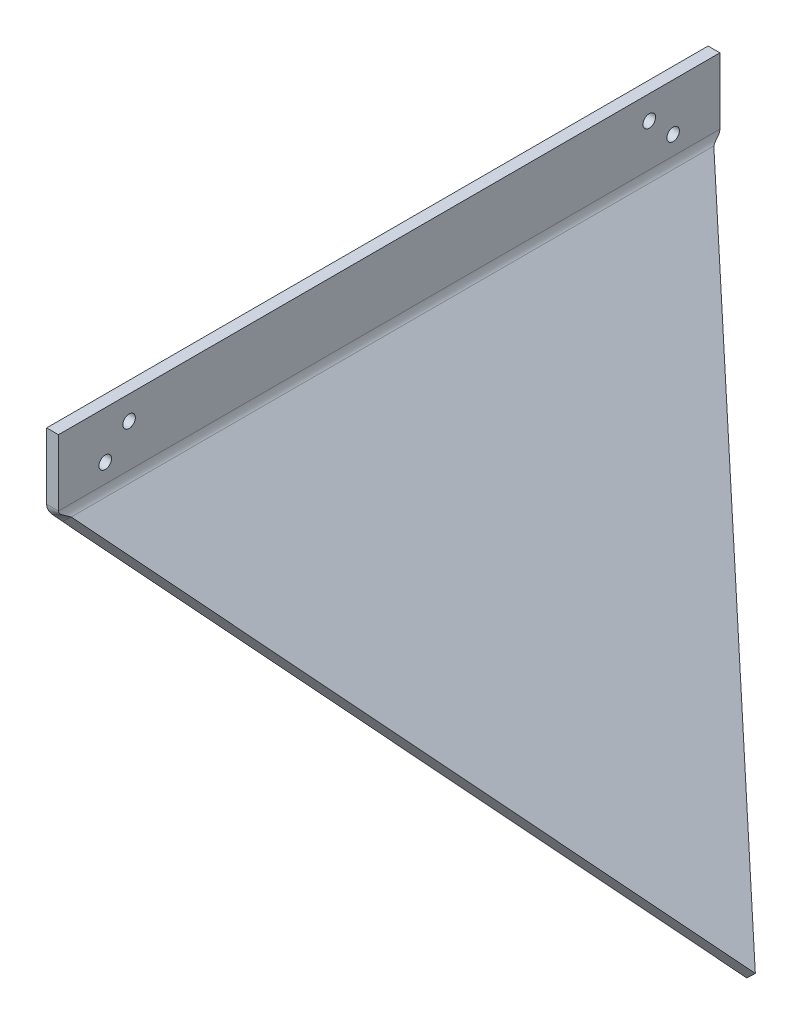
ISO-10303-21;
HEADER;
FILE_DESCRIPTION(('STEP AP214'),'2;1');
FILE_NAME('part.step','',(''),(''),'','','');
FILE_SCHEMA(('AUTOMOTIVE_DESIGN { 1 0 10303 214 1 1 1 1 }'));
ENDSEC;
DATA;
#1=APPLICATION_CONTEXT('core data for automotive mechanical design processes');
#2=APPLICATION_PROTOCOL_DEFINITION('international standard','automotive_design',2000,#1);
#3=PRODUCT_CONTEXT('',#1,'mechanical');
#4=PRODUCT('Part','Part','',(#3));
#5=PRODUCT_RELATED_PRODUCT_CATEGORY('part','',(#4));
#6=PRODUCT_DEFINITION_FORMATION('','',#4);
#7=PRODUCT_DEFINITION_CONTEXT('part definition',#1,'design');
#8=PRODUCT_DEFINITION('design','',#6,#7);
#9=PRODUCT_DEFINITION_SHAPE('','',#8);
#10=(LENGTH_UNIT() NAMED_UNIT(*) SI_UNIT(.MILLI.,.METRE.));
#11=(NAMED_UNIT(*) PLANE_ANGLE_UNIT() SI_UNIT($,.RADIAN.));
#12=(NAMED_UNIT(*) SI_UNIT($,.STERADIAN.) SOLID_ANGLE_UNIT());
#13=UNCERTAINTY_MEASURE_WITH_UNIT(LENGTH_MEASURE(1.E-05),#10,'distance_accuracy_value','');
#14=(GEOMETRIC_REPRESENTATION_CONTEXT(3) GLOBAL_UNCERTAINTY_ASSIGNED_CONTEXT((#13)) GLOBAL_UNIT_ASSIGNED_CONTEXT((#10,
#11,#12)) REPRESENTATION_CONTEXT('',''));
#15=CARTESIAN_POINT('',(0.,0.,0.));
#16=DIRECTION('',(0.,0.,1.));
#17=DIRECTION('',(1.,0.,0.));
#18=AXIS2_PLACEMENT_3D('',#15,#16,#17);
#19=CARTESIAN_POINT('',(-393.7,406.4,355.6));
#20=DIRECTION('',(-0.718240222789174,-0.695795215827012,0.));
#21=DIRECTION('',(0.695795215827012,-0.718240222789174,0.));
#22=AXIS2_PLACEMENT_3D('',#19,#20,#21);
#23=PLANE('',#22);
#24=DIRECTION('',(0.59237079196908,-0.611479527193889,-0.524585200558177));
#25=VECTOR('',#24,1.);
#26=CARTESIAN_POINT('',(-395.860168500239,408.629851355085,350.561487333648));
#27=LINE('',#26,#25);
#28=CARTESIAN_POINT('',(-390.121650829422,402.706220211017,345.479634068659));
#29=VERTEX_POINT('',#28);
#30=CARTESIAN_POINT('',(0.,0.,0.));
#31=VERTEX_POINT('',#30);
#32=EDGE_CURVE('E114',#29,#31,#27,.T.);
#33=ORIENTED_EDGE('',*,*,#32,.T.);
#34=DIRECTION('',(-0.59237079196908,0.611479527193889,-0.524585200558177));
#35=VECTOR('',#34,1.);
#36=CARTESIAN_POINT('',(-174.855514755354,180.496015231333,-154.846620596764));
#37=LINE('',#36,#35);
#38=CARTESIAN_POINT('',(-390.121650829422,402.706220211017,-345.479634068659));
#39=VERTEX_POINT('',#38);
#40=EDGE_CURVE('E144',#31,#39,#37,.T.);
#41=ORIENTED_EDGE('',*,*,#40,.T.);
#42=DIRECTION('',(0.,0.,-1.));
#43=VECTOR('',#42,1.);
#44=CARTESIAN_POINT('',(-390.121650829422,402.706220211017,355.6));
#45=LINE('',#44,#43);
#46=EDGE_CURVE('E139',#39,#29,#45,.F.);
#47=ORIENTED_EDGE('',*,*,#46,.T.);
#48=EDGE_LOOP('',(#33,#41,#47));
#49=FACE_BOUND('',#48,.T.);
#50=ADVANCED_FACE('F39',(#49),#23,.F.);
#51=CARTESIAN_POINT('',(-381.,411.54281945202,355.6));
#52=DIRECTION('',(0.,0.,1.));
#53=DIRECTION('',(1.,0.,0.));
#54=AXIS2_PLACEMENT_3D('',#51,#52,#53);
#55=CYLINDRICAL_SURFACE('',#54,12.7);
#56=CARTESIAN_POINT('',(-393.7,411.54281945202,355.6));
#57=CARTESIAN_POINT('',(-393.700000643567,411.483489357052,355.600002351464));
#58=CARTESIAN_POINT('',(-393.699584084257,411.42416786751,355.598680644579));
#59=CARTESIAN_POINT('',(-393.697923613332,411.305658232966,355.593396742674));
#60=CARTESIAN_POINT('',(-393.696679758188,411.24647007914,355.589434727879));
#61=CARTESIAN_POINT('',(-393.691722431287,411.069435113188,355.57361435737));
#62=CARTESIAN_POINT('',(-393.686783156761,410.951948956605,355.557821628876));
#63=CARTESIAN_POINT('',(-393.673867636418,410.720398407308,355.516392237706));
#64=CARTESIAN_POINT('',(-393.665928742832,410.606309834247,355.490876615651));
#65=CARTESIAN_POINT('',(-393.647231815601,410.380781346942,355.430663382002));
#66=CARTESIAN_POINT('',(-393.636472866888,410.269342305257,355.395962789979));
#67=CARTESIAN_POINT('',(-393.617064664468,410.092207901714,355.333232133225));
#68=CARTESIAN_POINT('',(-393.609208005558,410.025484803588,355.307810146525));
#69=CARTESIAN_POINT('',(-393.592607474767,409.893373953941,355.253958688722));
#70=CARTESIAN_POINT('',(-393.583863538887,409.827986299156,355.225529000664));
#71=CARTESIAN_POINT('',(-393.556391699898,409.633865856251,355.136075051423));
#72=CARTESIAN_POINT('',(-393.536425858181,409.507194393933,355.070892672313));
#73=CARTESIAN_POINT('',(-393.504362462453,409.32135531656,354.9658392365));
#74=CARTESIAN_POINT('',(-393.493291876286,409.259955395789,354.929508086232));
#75=CARTESIAN_POINT('',(-393.47052148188,409.138677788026,354.854619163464));
#76=CARTESIAN_POINT('',(-393.458821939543,409.078799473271,354.81606233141));
#77=CARTESIAN_POINT('',(-393.434851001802,408.960548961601,354.736860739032));
#78=CARTESIAN_POINT('',(-393.422579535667,408.902176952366,354.696215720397));
#79=CARTESIAN_POINT('',(-393.397527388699,408.786954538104,354.612962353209));
#80=CARTESIAN_POINT('',(-393.384746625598,408.730104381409,354.570353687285));
#81=CARTESIAN_POINT('',(-393.330756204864,408.497270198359,354.389913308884));
#82=CARTESIAN_POINT('',(-393.287472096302,408.327789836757,354.244206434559));
#83=CARTESIAN_POINT('',(-393.197791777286,408.002713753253,353.938930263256));
#84=CARTESIAN_POINT('',(-393.151393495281,407.847127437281,353.77935171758));
#85=CARTESIAN_POINT('',(-393.056591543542,407.548683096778,353.449054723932));
#86=CARTESIAN_POINT('',(-393.008186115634,407.405836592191,353.278326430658));
#87=CARTESIAN_POINT('',(-392.91029874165,407.131932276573,352.928114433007));
#88=CARTESIAN_POINT('',(-392.86081719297,407.000870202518,352.748633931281));
#89=CARTESIAN_POINT('',(-392.776090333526,406.786478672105,352.436562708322));
#90=CARTESIAN_POINT('',(-392.740952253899,406.700475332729,352.305761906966));
#91=CARTESIAN_POINT('',(-392.670793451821,406.533759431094,352.041645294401));
#92=CARTESIAN_POINT('',(-392.635772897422,406.453025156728,351.908343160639));
#93=CARTESIAN_POINT('',(-392.600819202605,406.374551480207,351.773719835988));
#94=B_SPLINE_CURVE_WITH_KNOTS('',3,(#56,#57,#58,#59,#60,#61,#62,#63,#64,#65,#66,#67,#68,#69,#70,
#71,#72,#73,#74,#75,#76,#77,#78,#79,#80,#81,#82,#83,#84,#85,#86,#87,#88,#89,#90,#91,#92,#93),
.UNSPECIFIED.,.F.,.F.,(4,2,2,2,2,2,2,2,2,2,2,2,2,2,2,2,2,2,4),(0.,0.177956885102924,
0.355901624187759,0.711286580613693,1.0623846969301,1.41359688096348,1.62902052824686,
1.84445972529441,2.27539818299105,2.49195300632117,2.70841698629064,2.92490780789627,
3.14143374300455,3.82323396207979,4.50549229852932,5.18836143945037,5.87098254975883,
6.35219440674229,6.83127855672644),.UNSPECIFIED.);
#95=CARTESIAN_POINT('',(-393.7,411.54281945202,355.6));
#96=VERTEX_POINT('',#95);
#97=CARTESIAN_POINT('',(-392.600819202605,406.374551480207,351.773719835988));
#98=VERTEX_POINT('',#97);
#99=EDGE_CURVE('E123',#96,#98,#94,.T.);
#100=ORIENTED_EDGE('',*,*,#99,.T.);
#101=CARTESIAN_POINT('',(-381.,411.54281945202,360.641381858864));
#102=DIRECTION('',(0.,0.863971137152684,-0.503541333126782));
#103=DIRECTION('',(0.,0.503541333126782,0.863971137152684));
#104=AXIS2_PLACEMENT_3D('',#101,#102,#103);
#105=ELLIPSE('',#104,25.2213654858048,12.7);
#106=EDGE_CURVE('E129',#98,#29,#105,.F.);
#107=ORIENTED_EDGE('',*,*,#106,.T.);
#108=ORIENTED_EDGE('',*,*,#46,.F.);
#109=CARTESIAN_POINT('',(-381.,411.54281945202,-360.641381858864));
#110=DIRECTION('',(0.,0.863971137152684,0.503541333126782));
#111=DIRECTION('',(0.,-0.503541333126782,0.863971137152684));
#112=AXIS2_PLACEMENT_3D('',#109,#110,#111);
#113=ELLIPSE('',#112,25.2213654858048,12.7);
#114=CARTESIAN_POINT('',(-392.600819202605,406.374551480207,-351.773719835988));
#115=VERTEX_POINT('',#114);
#116=EDGE_CURVE('E197',#39,#115,#113,.F.);
#117=ORIENTED_EDGE('',*,*,#116,.T.);
#118=CARTESIAN_POINT('',(-392.600819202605,406.374551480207,-351.773719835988));
#119=CARTESIAN_POINT('',(-392.63641931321,406.454477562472,-351.910831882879));
#120=CARTESIAN_POINT('',(-392.672101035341,406.536775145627,-352.046564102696));
#121=CARTESIAN_POINT('',(-392.743441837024,406.706488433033,-352.314858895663));
#122=CARTESIAN_POINT('',(-392.779100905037,406.793905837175,-352.447420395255));
#123=CARTESIAN_POINT('',(-392.850779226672,406.975684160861,-352.711051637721));
#124=CARTESIAN_POINT('',(-392.886794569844,407.070136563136,-352.842059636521));
#125=CARTESIAN_POINT('',(-392.958327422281,407.265064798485,-353.099662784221));
#126=CARTESIAN_POINT('',(-392.993844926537,407.36554069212,-353.226257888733));
#127=CARTESIAN_POINT('',(-393.075875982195,407.60776832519,-353.515941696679));
#128=CARTESIAN_POINT('',(-393.122079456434,407.752055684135,-353.677019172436));
#129=CARTESIAN_POINT('',(-393.212195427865,408.053262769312,-353.987827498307));
#130=CARTESIAN_POINT('',(-393.256106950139,408.210187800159,-354.137553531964));
#131=CARTESIAN_POINT('',(-393.340190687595,408.536512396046,-354.42159485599));
#132=CARTESIAN_POINT('',(-393.380385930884,408.705821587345,-354.556006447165));
#133=CARTESIAN_POINT('',(-393.455871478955,409.058133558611,-354.8070127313));
#134=CARTESIAN_POINT('',(-393.491167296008,409.241120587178,-354.923627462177));
#135=CARTESIAN_POINT('',(-393.54057030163,409.534082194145,-355.085884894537));
#136=CARTESIAN_POINT('',(-393.556990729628,409.639219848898,-355.139611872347));
#137=CARTESIAN_POINT('',(-393.587596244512,409.853405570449,-355.239403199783));
#138=CARTESIAN_POINT('',(-393.601781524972,409.962453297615,-355.285468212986));
#139=CARTESIAN_POINT('',(-393.627574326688,410.183865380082,-355.368924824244));
#140=CARTESIAN_POINT('',(-393.639187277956,410.296222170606,-355.40633470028));
#141=CARTESIAN_POINT('',(-393.659572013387,410.523853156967,-355.471760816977));
#142=CARTESIAN_POINT('',(-393.668344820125,410.639126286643,-355.499780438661));
#143=CARTESIAN_POINT('',(-393.683598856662,410.884746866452,-355.548323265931));
#144=CARTESIAN_POINT('',(-393.689720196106,411.015353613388,-355.567677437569));
#145=CARTESIAN_POINT('',(-393.695872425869,411.212410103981,-355.587062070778));
#146=CARTESIAN_POINT('',(-393.697418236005,411.278374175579,-355.591915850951));
#147=CARTESIAN_POINT('',(-393.699482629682,411.410494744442,-355.598386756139));
#148=CARTESIAN_POINT('',(-393.700000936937,411.476651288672,-355.600003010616));
#149=CARTESIAN_POINT('',(-393.7,411.54281945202,-355.6));
#150=B_SPLINE_CURVE_WITH_KNOTS('',3,(#118,#119,#120,#121,#122,#123,#124,#125,#126,#127,#128,
#129,#130,#131,#132,#133,#134,#135,#136,#137,#138,#139,#140,#141,#142,#143,#144,#145,#146,#147,
#148,#149),.UNSPECIFIED.,.F.,.F.,(4,2,2,2,2,2,2,2,2,2,2,2,2,2,2,4),(0.,0.487958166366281,
0.976079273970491,1.47234059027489,1.96860689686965,2.63142434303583,3.29452146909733,
3.95318721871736,4.61110580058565,4.96844668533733,5.32575660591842,5.68230492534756,
6.03872472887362,6.43449124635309,6.63289707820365,6.83135625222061),.UNSPECIFIED.);
#151=CARTESIAN_POINT('',(-393.7,411.54281945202,-355.6));
#152=VERTEX_POINT('',#151);
#153=EDGE_CURVE('E199',#115,#152,#150,.T.);
#154=ORIENTED_EDGE('',*,*,#153,.T.);
#155=DIRECTION('',(0.,0.,-1.));
#156=VECTOR('',#155,1.);
#157=CARTESIAN_POINT('',(-393.7,411.54281945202,-355.6));
#158=LINE('',#157,#156);
#159=EDGE_CURVE('E146',#96,#152,#158,.T.);
#160=ORIENTED_EDGE('',*,*,#159,.F.);
#161=EDGE_LOOP('',(#100,#107,#108,#117,#154,#160));
#162=FACE_BOUND('',#161,.T.);
#163=ADVANCED_FACE('F137',(#162),#55,.F.);
#164=CARTESIAN_POINT('',(-402.821650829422,397.563400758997,355.6));
#165=DIRECTION('',(-0.718240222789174,-0.695795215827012,0.));
#166=DIRECTION('',(0.695795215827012,-0.718240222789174,0.));
#167=AXIS2_PLACEMENT_3D('',#164,#165,#166);
#168=PLANE('',#167);
#169=DIRECTION('',(-0.59237079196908,0.611479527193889,-0.524585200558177));
#170=VECTOR('',#169,1.);
#171=CARTESIAN_POINT('',(-183.977165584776,171.65941599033,-154.846620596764));
#172=LINE('',#171,#170);
#173=CARTESIAN_POINT('',(-9.12165082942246,-8.83659924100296,0.));
#174=VERTEX_POINT('',#173);
#175=CARTESIAN_POINT('',(-399.243301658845,393.869620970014,-345.479634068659));
#176=VERTEX_POINT('',#175);
#177=EDGE_CURVE('E186',#174,#176,#172,.T.);
#178=ORIENTED_EDGE('',*,*,#177,.F.);
#179=DIRECTION('',(0.59237079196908,-0.611479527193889,-0.524585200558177));
#180=VECTOR('',#179,1.);
#181=CARTESIAN_POINT('',(-404.981819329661,399.793252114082,350.561487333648));
#182=LINE('',#181,#180);
#183=CARTESIAN_POINT('',(-399.243301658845,393.869620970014,345.479634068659));
#184=VERTEX_POINT('',#183);
#185=EDGE_CURVE('E80',#184,#174,#182,.T.);
#186=ORIENTED_EDGE('',*,*,#185,.F.);
#187=DIRECTION('',(0.,0.,1.));
#188=VECTOR('',#187,1.);
#189=CARTESIAN_POINT('',(-399.243301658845,393.869620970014,355.6));
#190=LINE('',#189,#188);
#191=EDGE_CURVE('E155',#176,#184,#190,.T.);
#192=ORIENTED_EDGE('',*,*,#191,.F.);
#193=EDGE_LOOP('',(#178,#186,#192));
#194=FACE_BOUND('',#193,.T.);
#195=ADVANCED_FACE('F230',(#194),#168,.T.);
#196=CARTESIAN_POINT('',(-381.,411.54281945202,355.6));
#197=DIRECTION('',(0.,0.,1.));
#198=DIRECTION('',(1.,0.,0.));
#199=AXIS2_PLACEMENT_3D('',#196,#197,#198);
#200=CYLINDRICAL_SURFACE('',#199,25.4);
#201=CARTESIAN_POINT('',(-381.,411.54281945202,360.641381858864));
#202=DIRECTION('',(0.,0.651120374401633,-0.758974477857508));
#203=DIRECTION('',(0.,0.758974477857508,0.651120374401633));
#204=AXIS2_PLACEMENT_3D('',#201,#202,#203);
#205=ELLIPSE('',#204,33.4662109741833,25.4);
#206=CARTESIAN_POINT('',(-404.20163840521,401.206283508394,351.773719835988));
#207=VERTEX_POINT('',#206);
#208=EDGE_CURVE('E132',#207,#184,#205,.F.);
#209=ORIENTED_EDGE('',*,*,#208,.F.);
#210=CARTESIAN_POINT('',(-406.4,411.54281945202,355.6));
#211=CARTESIAN_POINT('',(-406.400002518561,411.376950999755,355.600005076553));
#212=CARTESIAN_POINT('',(-406.398375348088,411.211082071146,355.597423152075));
#213=CARTESIAN_POINT('',(-406.391879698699,410.879573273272,355.587075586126));
#214=CARTESIAN_POINT('',(-406.387011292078,410.71393339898,355.579310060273));
#215=CARTESIAN_POINT('',(-406.374053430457,410.383161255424,355.558589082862));
#216=CARTESIAN_POINT('',(-406.365965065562,410.218028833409,355.545635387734));
#217=CARTESIAN_POINT('',(-406.346602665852,409.88843668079,355.514567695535));
#218=CARTESIAN_POINT('',(-406.335328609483,409.723976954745,355.496453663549));
#219=CARTESIAN_POINT('',(-406.309686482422,409.396507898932,355.455181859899));
#220=CARTESIAN_POINT('',(-406.29532908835,409.233495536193,355.432041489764));
#221=CARTESIAN_POINT('',(-406.263556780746,408.908555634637,355.380791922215));
#222=CARTESIAN_POINT('',(-406.246141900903,408.746628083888,355.352682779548));
#223=CARTESIAN_POINT('',(-406.208325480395,408.424053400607,355.291466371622));
#224=CARTESIAN_POINT('',(-406.187923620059,408.263406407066,355.258358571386));
#225=CARTESIAN_POINT('',(-406.144215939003,407.94358965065,355.187274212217));
#226=CARTESIAN_POINT('',(-406.120910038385,407.78441992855,355.149297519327));
#227=CARTESIAN_POINT('',(-406.067548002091,407.442508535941,355.062176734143));
#228=CARTESIAN_POINT('',(-406.037007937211,407.260049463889,355.012217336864));
#229=CARTESIAN_POINT('',(-405.972302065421,406.897604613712,354.906069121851));
#230=CARTESIAN_POINT('',(-405.938136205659,406.717618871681,354.849880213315));
#231=CARTESIAN_POINT('',(-405.866347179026,406.360351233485,354.731346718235));
#232=CARTESIAN_POINT('',(-405.828723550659,406.183069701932,354.669001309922));
#233=CARTESIAN_POINT('',(-405.769845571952,405.919398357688,354.570935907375));
#234=CARTESIAN_POINT('',(-405.749812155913,405.831881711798,354.537488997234));
#235=CARTESIAN_POINT('',(-405.708949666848,405.657599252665,354.469145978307));
#236=CARTESIAN_POINT('',(-405.688120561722,405.570833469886,354.434249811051));
#237=CARTESIAN_POINT('',(-405.624419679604,405.311472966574,354.327289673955));
#238=CARTESIAN_POINT('',(-405.580387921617,405.140054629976,354.253043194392));
#239=CARTESIAN_POINT('',(-405.489446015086,404.800570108,354.098869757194));
#240=CARTESIAN_POINT('',(-405.442535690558,404.632504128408,354.018942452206));
#241=CARTESIAN_POINT('',(-405.297839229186,404.133716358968,353.770879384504));
#242=CARTESIAN_POINT('',(-405.196052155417,403.808261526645,353.59440332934));
#243=CARTESIAN_POINT('',(-404.953509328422,403.082665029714,353.167390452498));
#244=CARTESIAN_POINT('',(-404.809881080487,402.687473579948,352.910033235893));
#245=CARTESIAN_POINT('',(-404.586729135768,402.115840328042,352.500632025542));
#246=CARTESIAN_POINT('',(-404.511195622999,401.92912219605,352.360529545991));
#247=CARTESIAN_POINT('',(-404.357942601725,401.5625410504,352.072737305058));
#248=CARTESIAN_POINT('',(-404.28022300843,401.382678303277,351.925047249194));
#249=CARTESIAN_POINT('',(-404.20163840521,401.206283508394,351.773719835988));
#250=B_SPLINE_CURVE_WITH_KNOTS('',3,(#210,#211,#212,#213,#214,#215,#216,#217,#218,#219,#220,
#221,#222,#223,#224,#225,#226,#227,#228,#229,#230,#231,#232,#233,#234,#235,#236,#237,#238,#239,
#240,#241,#242,#243,#244,#245,#246,#247,#248,#249),.UNSPECIFIED.,.F.,.F.,(4,2,2,2,2,2,2,2,2,2,2,
2,2,2,2,2,2,2,2,4),(0.,0.497577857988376,0.995144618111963,1.49254307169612,1.98994489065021,
2.48565136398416,2.98135237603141,3.47710647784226,3.9728742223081,4.54758927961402,
5.12231271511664,5.69711296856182,5.98452212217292,6.271942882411,6.84756731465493,
7.42322697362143,8.57407067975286,10.0508261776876,10.7866972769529,11.5225969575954),.UNSPECIFIED.);
#251=CARTESIAN_POINT('',(-406.4,411.54281945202,355.6));
#252=VERTEX_POINT('',#251);
#253=EDGE_CURVE('E141',#252,#207,#250,.T.);
#254=ORIENTED_EDGE('',*,*,#253,.F.);
#255=DIRECTION('',(0.,0.,1.));
#256=VECTOR('',#255,1.);
#257=CARTESIAN_POINT('',(-406.4,411.54281945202,355.6));
#258=LINE('',#257,#256);
#259=CARTESIAN_POINT('',(-406.4,411.54281945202,-355.6));
#260=VERTEX_POINT('',#259);
#261=EDGE_CURVE('E159',#252,#260,#258,.F.);
#262=ORIENTED_EDGE('',*,*,#261,.T.);
#263=CARTESIAN_POINT('',(-404.20163840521,401.206283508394,-351.773719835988));
#264=CARTESIAN_POINT('',(-404.301121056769,401.42956736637,-351.965278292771));
#265=CARTESIAN_POINT('',(-404.399251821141,401.658521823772,-352.150968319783));
#266=CARTESIAN_POINT('',(-404.591940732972,402.127691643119,-352.510239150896));
#267=CARTESIAN_POINT('',(-404.68649415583,402.367921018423,-352.683804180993));
#268=CARTESIAN_POINT('',(-404.870942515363,402.859100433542,-353.018036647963));
#269=CARTESIAN_POINT('',(-404.960835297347,403.110055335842,-353.178698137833));
#270=CARTESIAN_POINT('',(-405.134916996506,403.622033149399,-353.486353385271));
#271=CARTESIAN_POINT('',(-405.219107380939,403.883053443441,-353.63335066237));
#272=CARTESIAN_POINT('',(-405.380816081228,404.414501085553,-353.912995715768));
#273=CARTESIAN_POINT('',(-405.458337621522,404.684923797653,-354.045650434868));
#274=CARTESIAN_POINT('',(-405.605805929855,405.234477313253,-354.295982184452));
#275=CARTESIAN_POINT('',(-405.675756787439,405.513603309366,-354.413667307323));
#276=CARTESIAN_POINT('',(-405.767065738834,405.90675364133,-354.566303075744));
#277=CARTESIAN_POINT('',(-405.791994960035,406.017427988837,-354.607862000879));
#278=CARTESIAN_POINT('',(-405.840534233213,406.239912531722,-354.688642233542));
#279=CARTESIAN_POINT('',(-405.864144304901,406.3517227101,-354.727863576));
#280=CARTESIAN_POINT('',(-405.932924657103,406.688765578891,-354.84191070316));
#281=CARTESIAN_POINT('',(-405.97605447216,406.915650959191,-354.913135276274));
#282=CARTESIAN_POINT('',(-406.056457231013,407.372955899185,-355.045431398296));
#283=CARTESIAN_POINT('',(-406.093739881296,407.603368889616,-355.106519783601));
#284=CARTESIAN_POINT('',(-406.162231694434,408.067600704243,-355.218329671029));
#285=CARTESIAN_POINT('',(-406.19344069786,408.301419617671,-355.26905090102));
#286=CARTESIAN_POINT('',(-406.250793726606,408.782608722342,-355.361911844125));
#287=CARTESIAN_POINT('',(-406.276641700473,409.030110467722,-355.403554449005));
#288=CARTESIAN_POINT('',(-406.321151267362,409.527466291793,-355.474981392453));
#289=CARTESIAN_POINT('',(-406.339812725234,409.777320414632,-355.50476550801));
#290=CARTESIAN_POINT('',(-406.369807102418,410.279381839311,-355.552455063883));
#291=CARTESIAN_POINT('',(-406.381117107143,410.531594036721,-355.570323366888));
#292=CARTESIAN_POINT('',(-406.396220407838,411.036812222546,-355.59410775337));
#293=CARTESIAN_POINT('',(-406.400013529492,411.289818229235,-355.600023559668));
#294=CARTESIAN_POINT('',(-406.4,411.54281945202,-355.6));
#295=B_SPLINE_CURVE_WITH_KNOTS('',3,(#263,#264,#265,#266,#267,#268,#269,#270,#271,#272,#273,
#274,#275,#276,#277,#278,#279,#280,#281,#282,#283,#284,#285,#286,#287,#288,#289,#290,#291,#292,
#293,#294),.UNSPECIFIED.,.F.,.F.,(4,2,2,2,2,2,2,2,2,2,2,2,2,2,2,4),(0.,0.931604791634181,
1.86439981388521,2.79762230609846,3.73060375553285,4.6631315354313,5.5951530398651,
5.95758494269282,6.3200114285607,7.04473162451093,7.76823572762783,8.49175881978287,
9.24829227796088,10.004839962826,10.7637346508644,11.5226469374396),.UNSPECIFIED.);
#296=CARTESIAN_POINT('',(-404.20163840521,401.206283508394,-351.773719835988));
#297=VERTEX_POINT('',#296);
#298=EDGE_CURVE('E190',#297,#260,#295,.T.);
#299=ORIENTED_EDGE('',*,*,#298,.F.);
#300=CARTESIAN_POINT('',(-381.,411.54281945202,-360.641381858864));
#301=DIRECTION('',(0.,0.651120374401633,0.758974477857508));
#302=DIRECTION('',(0.,-0.758974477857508,0.651120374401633));
#303=AXIS2_PLACEMENT_3D('',#300,#301,#302);
#304=ELLIPSE('',#303,33.4662109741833,25.4);
#305=EDGE_CURVE('E198',#176,#297,#304,.F.);
#306=ORIENTED_EDGE('',*,*,#305,.F.);
#307=ORIENTED_EDGE('',*,*,#191,.T.);
#308=EDGE_LOOP('',(#209,#254,#262,#299,#306,#307));
#309=FACE_BOUND('',#308,.T.);
#310=ADVANCED_FACE('F233',(#309),#200,.T.);
#311=CARTESIAN_POINT('',(-393.7,406.4,-355.6));
#312=DIRECTION('',(0.,0.,1.));
#313=DIRECTION('',(0.,1.,0.));
#314=AXIS2_PLACEMENT_3D('',#311,#312,#313);
#315=PLANE('',#314);
#316=DIRECTION('',(1.,0.,0.));
#317=VECTOR('',#316,1.);
#318=CARTESIAN_POINT('',(-393.7,411.54281945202,-355.6));
#319=LINE('',#318,#317);
#320=EDGE_CURVE('E11',#260,#152,#319,.T.);
#321=ORIENTED_EDGE('',*,*,#320,.F.);
#322=DIRECTION('',(0.,-1.,0.));
#323=VECTOR('',#322,1.);
#324=CARTESIAN_POINT('',(-406.4,406.4,-355.6));
#325=LINE('',#324,#323);
#326=CARTESIAN_POINT('',(-406.4,482.6,-355.6));
#327=VERTEX_POINT('',#326);
#328=EDGE_CURVE('E167',#260,#327,#325,.F.);
#329=ORIENTED_EDGE('',*,*,#328,.T.);
#330=DIRECTION('',(1.,0.,0.));
#331=VECTOR('',#330,1.);
#332=CARTESIAN_POINT('',(-393.7,482.6,-355.6));
#333=LINE('',#332,#331);
#334=CARTESIAN_POINT('',(-393.7,482.6,-355.6));
#335=VERTEX_POINT('',#334);
#336=EDGE_CURVE('E47',#327,#335,#333,.T.);
#337=ORIENTED_EDGE('',*,*,#336,.T.);
#338=DIRECTION('',(0.,1.,0.));
#339=VECTOR('',#338,1.);
#340=CARTESIAN_POINT('',(-393.7,406.4,-355.6));
#341=LINE('',#340,#339);
#342=EDGE_CURVE('E158',#152,#335,#341,.T.);
#343=ORIENTED_EDGE('',*,*,#342,.F.);
#344=EDGE_LOOP('',(#321,#329,#337,#343));
#345=FACE_BOUND('',#344,.T.);
#346=ADVANCED_FACE('F41',(#345),#315,.F.);
#347=CARTESIAN_POINT('',(-393.7,482.6,355.6));
#348=DIRECTION('',(0.,1.,0.));
#349=DIRECTION('',(0.,0.,-1.));
#350=AXIS2_PLACEMENT_3D('',#347,#348,#349);
#351=PLANE('',#350);
#352=ORIENTED_EDGE('',*,*,#336,.F.);
#353=DIRECTION('',(0.,0.,1.));
#354=VECTOR('',#353,1.);
#355=CARTESIAN_POINT('',(-406.4,482.6,355.6));
#356=LINE('',#355,#354);
#357=CARTESIAN_POINT('',(-406.4,482.6,355.6));
#358=VERTEX_POINT('',#357);
#359=EDGE_CURVE('E165',#358,#327,#356,.F.);
#360=ORIENTED_EDGE('',*,*,#359,.F.);
#361=DIRECTION('',(1.,0.,0.));
#362=VECTOR('',#361,1.);
#363=CARTESIAN_POINT('',(-393.7,482.6,355.6));
#364=LINE('',#363,#362);
#365=CARTESIAN_POINT('',(-393.7,482.6,355.6));
#366=VERTEX_POINT('',#365);
#367=EDGE_CURVE('E63',#358,#366,#364,.T.);
#368=ORIENTED_EDGE('',*,*,#367,.T.);
#369=DIRECTION('',(0.,0.,-1.));
#370=VECTOR('',#369,1.);
#371=CARTESIAN_POINT('',(-393.7,482.6,355.6));
#372=LINE('',#371,#370);
#373=EDGE_CURVE('E178',#366,#335,#372,.T.);
#374=ORIENTED_EDGE('',*,*,#373,.T.);
#375=EDGE_LOOP('',(#352,#360,#368,#374));
#376=FACE_BOUND('',#375,.T.);
#377=ADVANCED_FACE('F181',(#376),#351,.T.);
#378=CARTESIAN_POINT('',(-393.7,406.4,355.6));
#379=DIRECTION('',(0.,0.,1.));
#380=DIRECTION('',(0.,1.,0.));
#381=AXIS2_PLACEMENT_3D('',#378,#379,#380);
#382=PLANE('',#381);
#383=ORIENTED_EDGE('',*,*,#367,.F.);
#384=DIRECTION('',(0.,-1.,0.));
#385=VECTOR('',#384,1.);
#386=CARTESIAN_POINT('',(-406.4,406.4,355.6));
#387=LINE('',#386,#385);
#388=EDGE_CURVE('E162',#252,#358,#387,.F.);
#389=ORIENTED_EDGE('',*,*,#388,.F.);
#390=DIRECTION('',(1.,0.,0.));
#391=VECTOR('',#390,1.);
#392=CARTESIAN_POINT('',(-393.7,411.54281945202,355.6));
#393=LINE('',#392,#391);
#394=EDGE_CURVE('E145',#252,#96,#393,.T.);
#395=ORIENTED_EDGE('',*,*,#394,.T.);
#396=DIRECTION('',(0.,1.,0.));
#397=VECTOR('',#396,1.);
#398=CARTESIAN_POINT('',(-393.7,406.4,355.6));
#399=LINE('',#398,#397);
#400=EDGE_CURVE('E151',#96,#366,#399,.T.);
#401=ORIENTED_EDGE('',*,*,#400,.T.);
#402=EDGE_LOOP('',(#383,#389,#395,#401));
#403=FACE_BOUND('',#402,.T.);
#404=ADVANCED_FACE('F224',(#403),#382,.T.);
#405=CARTESIAN_POINT('',(-393.7,406.4,355.6));
#406=DIRECTION('',(-1.,0.,0.));
#407=DIRECTION('',(0.,-1.,0.));
#408=AXIS2_PLACEMENT_3D('',#405,#406,#407);
#409=PLANE('',#408);
#410=CARTESIAN_POINT('',(-393.7,431.8,-305.315332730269));
#411=DIRECTION('',(-1.,0.,0.));
#412=DIRECTION('',(0.,-1.,0.));
#413=AXIS2_PLACEMENT_3D('',#410,#411,#412);
#414=CIRCLE('',#413,6.74687499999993);
#415=CARTESIAN_POINT('',(-393.7,425.053125,-305.315332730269));
#416=VERTEX_POINT('',#415);
#417=EDGE_CURVE('E515',#416,#416,#414,.T.);
#418=ORIENTED_EDGE('',*,*,#417,.T.);
#419=EDGE_LOOP('',(#418));
#420=FACE_BOUND('',#419,.T.);
#421=CARTESIAN_POINT('',(-393.7,457.2,-279.662217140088));
#422=DIRECTION('',(-1.,0.,0.));
#423=DIRECTION('',(0.,-1.,0.));
#424=AXIS2_PLACEMENT_3D('',#421,#422,#423);
#425=CIRCLE('',#424,6.74687499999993);
#426=CARTESIAN_POINT('',(-393.7,450.453125,-279.662217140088));
#427=VERTEX_POINT('',#426);
#428=EDGE_CURVE('E509',#427,#427,#425,.T.);
#429=ORIENTED_EDGE('',*,*,#428,.T.);
#430=EDGE_LOOP('',(#429));
#431=FACE_BOUND('',#430,.T.);
#432=CARTESIAN_POINT('',(-393.7,431.8,305.315332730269));
#433=DIRECTION('',(-1.,0.,0.));
#434=DIRECTION('',(0.,-1.,0.));
#435=AXIS2_PLACEMENT_3D('',#432,#433,#434);
#436=CIRCLE('',#435,6.74687499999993);
#437=CARTESIAN_POINT('',(-393.7,425.053125,305.315332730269));
#438=VERTEX_POINT('',#437);
#439=EDGE_CURVE('E503',#438,#438,#436,.T.);
#440=ORIENTED_EDGE('',*,*,#439,.T.);
#441=EDGE_LOOP('',(#440));
#442=FACE_BOUND('',#441,.T.);
#443=CARTESIAN_POINT('',(-393.7,457.2,279.662217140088));
#444=DIRECTION('',(-1.,0.,0.));
#445=DIRECTION('',(0.,-1.,0.));
#446=AXIS2_PLACEMENT_3D('',#443,#444,#445);
#447=CIRCLE('',#446,6.74687499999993);
#448=CARTESIAN_POINT('',(-393.7,450.453125,279.662217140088));
#449=VERTEX_POINT('',#448);
#450=EDGE_CURVE('E496',#449,#449,#447,.T.);
#451=ORIENTED_EDGE('',*,*,#450,.T.);
#452=EDGE_LOOP('',(#451));
#453=FACE_BOUND('',#452,.T.);
#454=ORIENTED_EDGE('',*,*,#400,.F.);
#455=ORIENTED_EDGE('',*,*,#159,.T.);
#456=ORIENTED_EDGE('',*,*,#342,.T.);
#457=ORIENTED_EDGE('',*,*,#373,.F.);
#458=EDGE_LOOP('',(#454,#455,#456,#457));
#459=FACE_BOUND('',#458,.T.);
#460=ADVANCED_FACE('F177',(#420,#431,#442,#453,#459),#409,.F.);
#461=CARTESIAN_POINT('',(-406.4,406.4,355.6));
#462=DIRECTION('',(-1.,0.,0.));
#463=DIRECTION('',(0.,-1.,0.));
#464=AXIS2_PLACEMENT_3D('',#461,#462,#463);
#465=PLANE('',#464);
#466=CARTESIAN_POINT('',(-406.4,431.8,-305.315332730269));
#467=DIRECTION('',(-1.,0.,0.));
#468=DIRECTION('',(0.,0.,1.));
#469=AXIS2_PLACEMENT_3D('',#466,#467,#468);
#470=CIRCLE('',#469,6.74687499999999);
#471=CARTESIAN_POINT('',(-406.4,431.8,-298.568457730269));
#472=VERTEX_POINT('',#471);
#473=EDGE_CURVE('E518',#472,#472,#470,.T.);
#474=ORIENTED_EDGE('',*,*,#473,.F.);
#475=EDGE_LOOP('',(#474));
#476=FACE_BOUND('',#475,.T.);
#477=CARTESIAN_POINT('',(-406.4,457.2,-279.662217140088));
#478=DIRECTION('',(-1.,0.,0.));
#479=DIRECTION('',(0.,0.,1.));
#480=AXIS2_PLACEMENT_3D('',#477,#478,#479);
#481=CIRCLE('',#480,6.74687499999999);
#482=CARTESIAN_POINT('',(-406.4,457.2,-272.915342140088));
#483=VERTEX_POINT('',#482);
#484=EDGE_CURVE('E512',#483,#483,#481,.T.);
#485=ORIENTED_EDGE('',*,*,#484,.F.);
#486=EDGE_LOOP('',(#485));
#487=FACE_BOUND('',#486,.T.);
#488=CARTESIAN_POINT('',(-406.4,431.8,305.315332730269));
#489=DIRECTION('',(-1.,0.,0.));
#490=DIRECTION('',(0.,0.,1.));
#491=AXIS2_PLACEMENT_3D('',#488,#489,#490);
#492=CIRCLE('',#491,6.74687499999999);
#493=CARTESIAN_POINT('',(-406.4,431.8,312.062207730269));
#494=VERTEX_POINT('',#493);
#495=EDGE_CURVE('E506',#494,#494,#492,.T.);
#496=ORIENTED_EDGE('',*,*,#495,.F.);
#497=EDGE_LOOP('',(#496));
#498=FACE_BOUND('',#497,.T.);
#499=CARTESIAN_POINT('',(-406.4,457.2,279.662217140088));
#500=DIRECTION('',(-1.,0.,0.));
#501=DIRECTION('',(0.,0.,1.));
#502=AXIS2_PLACEMENT_3D('',#499,#500,#501);
#503=CIRCLE('',#502,6.74687499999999);
#504=CARTESIAN_POINT('',(-406.4,457.2,286.409092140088));
#505=VERTEX_POINT('',#504);
#506=EDGE_CURVE('E500',#505,#505,#503,.T.);
#507=ORIENTED_EDGE('',*,*,#506,.F.);
#508=EDGE_LOOP('',(#507));
#509=FACE_BOUND('',#508,.T.);
#510=ORIENTED_EDGE('',*,*,#388,.T.);
#511=ORIENTED_EDGE('',*,*,#359,.T.);
#512=ORIENTED_EDGE('',*,*,#328,.F.);
#513=ORIENTED_EDGE('',*,*,#261,.F.);
#514=EDGE_LOOP('',(#510,#511,#512,#513));
#515=FACE_BOUND('',#514,.T.);
#516=ADVANCED_FACE('F220',(#476,#487,#498,#509,#515),#465,.T.);
#517=CARTESIAN_POINT('',(-183.977165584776,171.65941599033,-154.846620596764));
#518=DIRECTION('',(-0.365003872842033,0.376778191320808,0.851357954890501));
#519=DIRECTION('',(-0.59237079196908,0.611479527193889,-0.524585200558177));
#520=AXIS2_PLACEMENT_3D('',#517,#518,#519);
#521=PLANE('',#520);
#522=ORIENTED_EDGE('',*,*,#177,.T.);
#523=DIRECTION('',(-0.718240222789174,-0.695795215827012,0.));
#524=VECTOR('',#523,1.);
#525=CARTESIAN_POINT('',(-399.243301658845,393.869620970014,-345.479634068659));
#526=LINE('',#525,#524);
#527=EDGE_CURVE('E54',#176,#39,#526,.F.);
#528=ORIENTED_EDGE('',*,*,#527,.T.);
#529=ORIENTED_EDGE('',*,*,#40,.F.);
#530=DIRECTION('',(-0.718240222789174,-0.695795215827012,0.));
#531=VECTOR('',#530,1.);
#532=CARTESIAN_POINT('',(-9.12165082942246,-8.83659924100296,0.));
#533=LINE('',#532,#531);
#534=EDGE_CURVE('E118',#174,#31,#533,.F.);
#535=ORIENTED_EDGE('',*,*,#534,.F.);
#536=EDGE_LOOP('',(#522,#528,#529,#535));
#537=FACE_BOUND('',#536,.T.);
#538=ADVANCED_FACE('F217',(#537),#521,.F.);
#539=CARTESIAN_POINT('',(-392.484811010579,406.426234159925,-351.773719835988));
#540=CARTESIAN_POINT('',(-392.789557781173,407.110276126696,-352.959247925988));
#541=CARTESIAN_POINT('',(-393.067327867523,407.901092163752,-353.918188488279));
#542=CARTESIAN_POINT('',(-393.461708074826,409.648509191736,-355.246834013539));
#543=CARTESIAN_POINT('',(-393.573,410.573341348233,-355.6));
#544=CARTESIAN_POINT('',(-393.573,411.54281945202,-355.6));
#545=CARTESIAN_POINT('',(-392.600819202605,406.374551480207,-351.773719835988));
#546=CARTESIAN_POINT('',(-392.908644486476,407.065503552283,-352.9592484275));
#547=CARTESIAN_POINT('',(-393.189220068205,407.864307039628,-353.918188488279));
#548=CARTESIAN_POINT('',(-393.587583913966,409.629374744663,-355.246834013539));
#549=CARTESIAN_POINT('',(-393.7,410.563548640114,-355.6));
#550=CARTESIAN_POINT('',(-393.7,411.54281945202,-355.6));
#551=CARTESIAN_POINT('',(-404.20163840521,401.206283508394,-351.773719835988));
#552=CARTESIAN_POINT('',(-404.817315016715,402.588246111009,-352.95929857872));
#553=CARTESIAN_POINT('',(-405.378440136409,404.185794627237,-353.918188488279));
#554=CARTESIAN_POINT('',(-406.175167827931,407.715930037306,-355.246834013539));
#555=CARTESIAN_POINT('',(-406.4,409.584277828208,-355.6));
#556=CARTESIAN_POINT('',(-406.4,411.54281945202,-355.6));
#557=CARTESIAN_POINT('',(-404.318806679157,401.154084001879,-351.773719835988));
#558=CARTESIAN_POINT('',(-404.93759258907,402.543025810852,-352.959299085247));
#559=CARTESIAN_POINT('',(-405.501551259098,404.148641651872,-353.918188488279));
#560=CARTESIAN_POINT('',(-406.302302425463,407.696604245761,-355.246834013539));
#561=CARTESIAN_POINT('',(-406.52827,409.574387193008,-355.6));
#562=CARTESIAN_POINT('',(-406.52827,411.54281945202,-355.6));
#563=B_SPLINE_SURFACE_WITH_KNOTS('',1,3,((#539,#540,#541,#542,#543,#544),(#545,#546,#547,#548,
#549,#550),(#551,#552,#553,#554,#555,#556),(#557,#558,#559,#560,#561,#562)),.UNSPECIFIED.,.F.,
.F.,.F.,(2,1,1,2),(4,2,4),(-0.01,0.,1.,1.0101),(0.,0.00573649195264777,0.0114729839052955),.UNSPECIFIED.);
#564=DIRECTION('',(0.913450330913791,0.406950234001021,0.));
#565=VECTOR('',#564,1.);
#566=CARTESIAN_POINT('',(-398.401228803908,403.7904174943,-351.773719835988));
#567=LINE('',#566,#565);
#568=EDGE_CURVE('E188',#297,#115,#567,.T.);
#569=ORIENTED_EDGE('',*,*,#568,.F.);
#570=ORIENTED_EDGE('',*,*,#298,.T.);
#571=ORIENTED_EDGE('',*,*,#320,.T.);
#572=ORIENTED_EDGE('',*,*,#153,.F.);
#573=EDGE_LOOP('',(#569,#570,#571,#572));
#574=FACE_BOUND('',#573,.T.);
#575=ADVANCED_FACE('F205',(#574),#563,.T.);
#576=CARTESIAN_POINT('',(-381.,386.14281945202,-338.85085003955));
#577=CARTESIAN_POINT('',(-381.,390.376152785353,-338.85085003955));
#578=CARTESIAN_POINT('',(-381.,394.609486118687,-338.85085003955));
#579=CARTESIAN_POINT('',(-381.,398.84281945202,-338.85085003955));
#580=CARTESIAN_POINT('',(-431.8,386.14281945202,-338.85085003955));
#581=CARTESIAN_POINT('',(-423.333333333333,390.376152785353,-338.85085003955));
#582=CARTESIAN_POINT('',(-414.866666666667,394.609486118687,-338.85085003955));
#583=CARTESIAN_POINT('',(-406.4,398.84281945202,-338.85085003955));
#584=CARTESIAN_POINT('',(-431.8,436.94281945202,-382.431913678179));
#585=CARTESIAN_POINT('',(-423.333333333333,432.709486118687,-382.431913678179));
#586=CARTESIAN_POINT('',(-414.866666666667,428.476152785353,-382.431913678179));
#587=CARTESIAN_POINT('',(-406.4,424.24281945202,-382.431913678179));
#588=CARTESIAN_POINT('',(-381.,436.94281945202,-382.431913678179));
#589=CARTESIAN_POINT('',(-381.,432.709486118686,-382.431913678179));
#590=CARTESIAN_POINT('',(-381.,428.476152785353,-382.431913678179));
#591=CARTESIAN_POINT('',(-381.,424.24281945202,-382.431913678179));
#592=CARTESIAN_POINT('',(-330.2,436.94281945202,-382.431913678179));
#593=CARTESIAN_POINT('',(-338.666666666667,432.709486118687,-382.431913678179));
#594=CARTESIAN_POINT('',(-347.133333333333,428.476152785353,-382.431913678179));
#595=CARTESIAN_POINT('',(-355.6,424.24281945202,-382.431913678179));
#596=CARTESIAN_POINT('',(-330.2,386.14281945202,-338.85085003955));
#597=CARTESIAN_POINT('',(-338.666666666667,390.376152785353,-338.85085003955));
#598=CARTESIAN_POINT('',(-347.133333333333,394.609486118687,-338.85085003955));
#599=CARTESIAN_POINT('',(-355.6,398.84281945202,-338.85085003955));
#600=CARTESIAN_POINT('',(-381.,386.14281945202,-338.85085003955));
#601=CARTESIAN_POINT('',(-381.,390.376152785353,-338.85085003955));
#602=CARTESIAN_POINT('',(-381.,394.609486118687,-338.85085003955));
#603=CARTESIAN_POINT('',(-381.,398.84281945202,-338.85085003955));
#604=(BOUNDED_SURFACE() B_SPLINE_SURFACE(3,3,((#576,#577,#578,#579),(#580,#581,#582,#583),(#584,
#585,#586,#587),(#588,#589,#590,#591),(#592,#593,#594,#595),(#596,#597,#598,#599),(#600,#601,
#602,#603)),.UNSPECIFIED.,.T.,.F.,.F.) B_SPLINE_SURFACE_WITH_KNOTS((4,3,4),(4,4),(0.,0.5,1.),
(0.,1.),.UNSPECIFIED.) GEOMETRIC_REPRESENTATION_ITEM() RATIONAL_B_SPLINE_SURFACE(((1.,1.,1.,1.),
(0.333333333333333,0.333333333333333,0.333333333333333,0.333333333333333),(0.333333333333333,
0.333333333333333,0.333333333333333,0.333333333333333),(1.,1.,1.,1.),(0.333333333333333,
0.333333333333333,0.333333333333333,0.333333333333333),(0.333333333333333,0.333333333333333,
0.333333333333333,0.333333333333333),(1.,1.,1.,1.))) REPRESENTATION_ITEM('') SURFACE());
#605=ORIENTED_EDGE('',*,*,#305,.T.);
#606=ORIENTED_EDGE('',*,*,#568,.T.);
#607=ORIENTED_EDGE('',*,*,#116,.F.);
#608=ORIENTED_EDGE('',*,*,#527,.F.);
#609=EDGE_LOOP('',(#605,#606,#607,#608));
#610=FACE_BOUND('',#609,.T.);
#611=ADVANCED_FACE('F212',(#610),#604,.T.);
#612=CARTESIAN_POINT('',(-404.981819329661,399.793252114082,350.561487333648));
#613=DIRECTION('',(-0.365003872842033,0.376778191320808,-0.851357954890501));
#614=DIRECTION('',(0.59237079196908,-0.611479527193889,-0.524585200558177));
#615=AXIS2_PLACEMENT_3D('',#612,#613,#614);
#616=PLANE('',#615);
#617=ORIENTED_EDGE('',*,*,#185,.T.);
#618=ORIENTED_EDGE('',*,*,#534,.T.);
#619=ORIENTED_EDGE('',*,*,#32,.F.);
#620=DIRECTION('',(-0.718240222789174,-0.695795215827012,0.));
#621=VECTOR('',#620,1.);
#622=CARTESIAN_POINT('',(-399.243301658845,393.869620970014,345.479634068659));
#623=LINE('',#622,#621);
#624=EDGE_CURVE('E117',#184,#29,#623,.F.);
#625=ORIENTED_EDGE('',*,*,#624,.F.);
#626=EDGE_LOOP('',(#617,#618,#619,#625));
#627=FACE_BOUND('',#626,.T.);
#628=ADVANCED_FACE('F116',(#627),#616,.F.);
#629=CARTESIAN_POINT('',(-393.573,411.54281945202,355.6));
#630=CARTESIAN_POINT('',(-393.573,411.063219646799,355.6));
#631=CARTESIAN_POINT('',(-393.545667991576,410.592804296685,355.512070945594));
#632=CARTESIAN_POINT('',(-393.441296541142,409.669198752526,355.171297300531));
#633=CARTESIAN_POINT('',(-393.362977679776,409.211226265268,354.914205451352));
#634=CARTESIAN_POINT('',(-393.068298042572,407.905049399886,353.92147934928));
#635=CARTESIAN_POINT('',(-392.792695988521,407.117320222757,352.971465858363));
#636=CARTESIAN_POINT('',(-392.484811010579,406.426234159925,351.773719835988));
#637=CARTESIAN_POINT('',(-393.7,411.54281945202,355.6));
#638=CARTESIAN_POINT('',(-393.7,411.058375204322,355.6));
#639=CARTESIAN_POINT('',(-393.672391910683,410.583208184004,355.512070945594));
#640=CARTESIAN_POINT('',(-393.566966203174,409.650273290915,355.171297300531));
#641=CARTESIAN_POINT('',(-393.487856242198,409.187674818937,354.914205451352));
#642=CARTESIAN_POINT('',(-393.190200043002,407.868304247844,353.92147934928));
#643=CARTESIAN_POINT('',(-392.91181936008,407.072629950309,352.971475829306));
#644=CARTESIAN_POINT('',(-392.600819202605,406.374551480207,351.773719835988));
#645=CARTESIAN_POINT('',(-406.4,411.54281945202,355.6));
#646=CARTESIAN_POINT('',(-406.4,410.573930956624,355.6));
#647=CARTESIAN_POINT('',(-406.344783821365,409.623596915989,355.512070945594));
#648=CARTESIAN_POINT('',(-406.133932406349,407.75772712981,355.171297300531));
#649=CARTESIAN_POINT('',(-405.975712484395,406.832530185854,354.914205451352));
#650=CARTESIAN_POINT('',(-405.380400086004,404.193789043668,353.92147934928));
#651=CARTESIAN_POINT('',(-404.824156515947,402.603602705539,352.97247292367));
#652=CARTESIAN_POINT('',(-404.20163840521,401.206283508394,351.773719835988));
#653=CARTESIAN_POINT('',(-406.52827,411.54281945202,355.6));
#654=CARTESIAN_POINT('',(-406.52827,410.569038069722,355.6));
#655=CARTESIAN_POINT('',(-406.472774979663,409.613904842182,355.512070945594));
#656=CARTESIAN_POINT('',(-406.260858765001,407.738612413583,355.171297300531));
#657=CARTESIAN_POINT('',(-406.101839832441,406.80874322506,354.914205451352));
#658=CARTESIAN_POINT('',(-405.503521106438,404.156676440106,353.92147934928));
#659=CARTESIAN_POINT('',(-404.944471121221,402.558465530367,352.972482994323));
#660=CARTESIAN_POINT('',(-404.318806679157,401.154084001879,351.773719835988));
#661=B_SPLINE_SURFACE_WITH_KNOTS('',1,3,((#629,#630,#631,#632,#633,#634,#635,#636),(#637,#638,
#639,#640,#641,#642,#643,#644),(#645,#646,#647,#648,#649,#650,#651,#652),(#653,#654,#655,#656,
#657,#658,#659,#660)),.UNSPECIFIED.,.F.,.F.,.F.,(2,1,1,2),(4,2,2,4),(-0.01,0.,1.,1.0101),(0.,
0.00286099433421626,0.00572198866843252,0.011443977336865),.UNSPECIFIED.);
#662=DIRECTION('',(0.91345033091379,0.406950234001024,0.));
#663=VECTOR('',#662,1.);
#664=CARTESIAN_POINT('',(-398.401228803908,403.7904174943,351.773719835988));
#665=LINE('',#664,#663);
#666=EDGE_CURVE('E142',#207,#98,#665,.T.);
#667=ORIENTED_EDGE('',*,*,#394,.F.);
#668=ORIENTED_EDGE('',*,*,#253,.T.);
#669=ORIENTED_EDGE('',*,*,#666,.T.);
#670=ORIENTED_EDGE('',*,*,#99,.F.);
#671=EDGE_LOOP('',(#667,#668,#669,#670));
#672=FACE_BOUND('',#671,.T.);
#673=ADVANCED_FACE('F292',(#672),#661,.T.);
#674=CARTESIAN_POINT('',(-381.,436.94281945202,382.431913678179));
#675=CARTESIAN_POINT('',(-381.,432.709486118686,382.431913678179));
#676=CARTESIAN_POINT('',(-381.,428.476152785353,382.431913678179));
#677=CARTESIAN_POINT('',(-381.,424.24281945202,382.431913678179));
#678=CARTESIAN_POINT('',(-431.8,436.94281945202,382.431913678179));
#679=CARTESIAN_POINT('',(-423.333333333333,432.709486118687,382.431913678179));
#680=CARTESIAN_POINT('',(-414.866666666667,428.476152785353,382.431913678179));
#681=CARTESIAN_POINT('',(-406.4,424.24281945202,382.431913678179));
#682=CARTESIAN_POINT('',(-431.8,386.14281945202,338.85085003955));
#683=CARTESIAN_POINT('',(-423.333333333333,390.376152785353,338.85085003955));
#684=CARTESIAN_POINT('',(-414.866666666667,394.609486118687,338.85085003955));
#685=CARTESIAN_POINT('',(-406.4,398.84281945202,338.85085003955));
#686=CARTESIAN_POINT('',(-381.,386.14281945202,338.85085003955));
#687=CARTESIAN_POINT('',(-381.,390.376152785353,338.85085003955));
#688=CARTESIAN_POINT('',(-381.,394.609486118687,338.85085003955));
#689=CARTESIAN_POINT('',(-381.,398.84281945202,338.85085003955));
#690=CARTESIAN_POINT('',(-330.2,386.14281945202,338.85085003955));
#691=CARTESIAN_POINT('',(-338.666666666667,390.376152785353,338.85085003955));
#692=CARTESIAN_POINT('',(-347.133333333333,394.609486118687,338.85085003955));
#693=CARTESIAN_POINT('',(-355.6,398.84281945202,338.85085003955));
#694=CARTESIAN_POINT('',(-330.2,436.94281945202,382.431913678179));
#695=CARTESIAN_POINT('',(-338.666666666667,432.709486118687,382.431913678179));
#696=CARTESIAN_POINT('',(-347.133333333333,428.476152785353,382.431913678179));
#697=CARTESIAN_POINT('',(-355.6,424.24281945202,382.431913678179));
#698=CARTESIAN_POINT('',(-381.,436.94281945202,382.431913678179));
#699=CARTESIAN_POINT('',(-381.,432.709486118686,382.431913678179));
#700=CARTESIAN_POINT('',(-381.,428.476152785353,382.431913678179));
#701=CARTESIAN_POINT('',(-381.,424.24281945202,382.431913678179));
#702=(BOUNDED_SURFACE() B_SPLINE_SURFACE(3,3,((#674,#675,#676,#677),(#678,#679,#680,#681),(#682,
#683,#684,#685),(#686,#687,#688,#689),(#690,#691,#692,#693),(#694,#695,#696,#697),(#698,#699,
#700,#701)),.UNSPECIFIED.,.T.,.F.,.F.) B_SPLINE_SURFACE_WITH_KNOTS((4,3,4),(4,4),(0.,0.5,1.),
(0.,1.),.UNSPECIFIED.) GEOMETRIC_REPRESENTATION_ITEM() RATIONAL_B_SPLINE_SURFACE(((1.,1.,1.,1.),
(0.333333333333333,0.333333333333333,0.333333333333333,0.333333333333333),(0.333333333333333,
0.333333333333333,0.333333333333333,0.333333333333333),(1.,1.,1.,1.),(0.333333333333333,
0.333333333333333,0.333333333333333,0.333333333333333),(0.333333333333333,0.333333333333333,
0.333333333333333,0.333333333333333),(1.,1.,1.,1.))) REPRESENTATION_ITEM('') SURFACE());
#703=ORIENTED_EDGE('',*,*,#208,.T.);
#704=ORIENTED_EDGE('',*,*,#624,.T.);
#705=ORIENTED_EDGE('',*,*,#106,.F.);
#706=ORIENTED_EDGE('',*,*,#666,.F.);
#707=EDGE_LOOP('',(#703,#704,#705,#706));
#708=FACE_BOUND('',#707,.T.);
#709=ADVANCED_FACE('F127',(#708),#702,.T.);
#710=CARTESIAN_POINT('',(-406.4,457.2,279.662217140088));
#711=DIRECTION('',(-1.,0.,0.));
#712=DIRECTION('',(0.,0.,1.));
#713=AXIS2_PLACEMENT_3D('',#710,#711,#712);
#714=CYLINDRICAL_SURFACE('',#713,6.74687499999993);
#715=ORIENTED_EDGE('',*,*,#506,.T.);
#716=EDGE_LOOP('',(#715));
#717=FACE_BOUND('',#716,.T.);
#718=ORIENTED_EDGE('',*,*,#450,.F.);
#719=EDGE_LOOP('',(#718));
#720=FACE_BOUND('',#719,.T.);
#721=ADVANCED_FACE('F277',(#717,#720),#714,.F.);
#722=CARTESIAN_POINT('',(-406.4,431.8,305.315332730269));
#723=DIRECTION('',(-1.,0.,0.));
#724=DIRECTION('',(0.,0.,1.));
#725=AXIS2_PLACEMENT_3D('',#722,#723,#724);
#726=CYLINDRICAL_SURFACE('',#725,6.74687499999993);
#727=ORIENTED_EDGE('',*,*,#495,.T.);
#728=EDGE_LOOP('',(#727));
#729=FACE_BOUND('',#728,.T.);
#730=ORIENTED_EDGE('',*,*,#439,.F.);
#731=EDGE_LOOP('',(#730));
#732=FACE_BOUND('',#731,.T.);
#733=ADVANCED_FACE('F269',(#729,#732),#726,.F.);
#734=CARTESIAN_POINT('',(-406.4,457.2,-279.662217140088));
#735=DIRECTION('',(-1.,0.,0.));
#736=DIRECTION('',(0.,0.,1.));
#737=AXIS2_PLACEMENT_3D('',#734,#735,#736);
#738=CYLINDRICAL_SURFACE('',#737,6.74687499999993);
#739=ORIENTED_EDGE('',*,*,#484,.T.);
#740=EDGE_LOOP('',(#739));
#741=FACE_BOUND('',#740,.T.);
#742=ORIENTED_EDGE('',*,*,#428,.F.);
#743=EDGE_LOOP('',(#742));
#744=FACE_BOUND('',#743,.T.);
#745=ADVANCED_FACE('F261',(#741,#744),#738,.F.);
#746=CARTESIAN_POINT('',(-406.4,431.8,-305.315332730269));
#747=DIRECTION('',(-1.,0.,0.));
#748=DIRECTION('',(0.,0.,1.));
#749=AXIS2_PLACEMENT_3D('',#746,#747,#748);
#750=CYLINDRICAL_SURFACE('',#749,6.74687499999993);
#751=ORIENTED_EDGE('',*,*,#473,.T.);
#752=EDGE_LOOP('',(#751));
#753=FACE_BOUND('',#752,.T.);
#754=ORIENTED_EDGE('',*,*,#417,.F.);
#755=EDGE_LOOP('',(#754));
#756=FACE_BOUND('',#755,.T.);
#757=ADVANCED_FACE('F257',(#753,#756),#750,.F.);
#758=CLOSED_SHELL('',(#50,#163,#195,#310,#346,#377,#404,#460,#516,#538,#575,#611,#628,#673,#709,
#721,#733,#745,#757));
#759=MANIFOLD_SOLID_BREP('B2',#758);
#760=ADVANCED_BREP_SHAPE_REPRESENTATION('',(#18,#759),#14);
#761=SHAPE_DEFINITION_REPRESENTATION(#9,#760);
ENDSEC;
END-ISO-10303-21;
